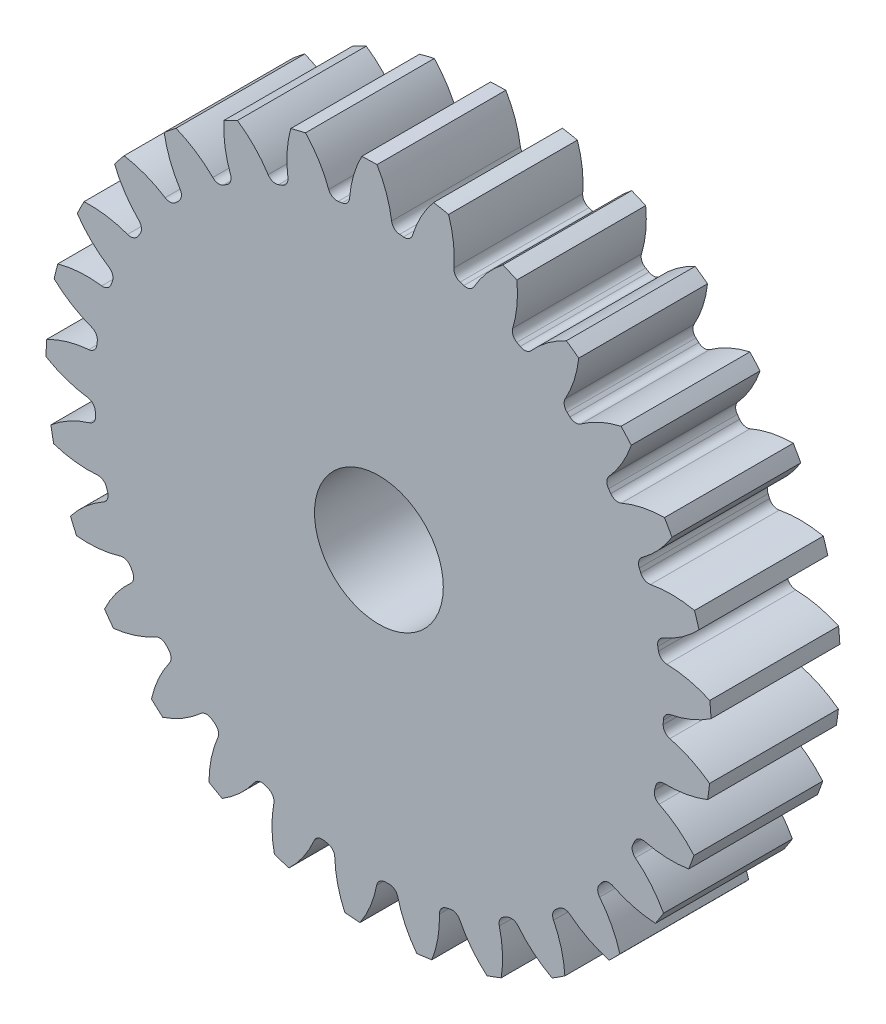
from build123d import *

# Parameters (mm, degrees)
SKETCH3_R         = 262.466666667
GEARBODY_DEPTH    = 101.6
TOOTHCUT_DEPTH    = 385.83770894
CIRPATTERN1_COUNT = 29
BOREDIA_R         = 50.8
BORE_DEPTH        = 12700


with BuildPart() as part:
    # Sketch3 → gearBody (new body)
    with BuildSketch(Plane.XY):
        Circle(SKETCH3_R)
    extrude(amount=GEARBODY_DEPTH)

    # Sketch2 → toothCut (cut, through all)
    with BuildSketch(Plane.XY):
        with BuildLine():
            ThreePointArc((224.249253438, -7.257647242), (224.293386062, -5.733941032), (224.327165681, -4.209970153))
            ThreePointArc((224.327165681, -4.209970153), (225.940127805, 0.09284515), (229.899366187, 2.425289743))
            ThreePointArc((229.899366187, 2.425289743), (246.875965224, 7.566161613), (262.466666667, 16.025683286))
            ThreePointArc((262.466666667, 16.025683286), (262.869575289, -6.720120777), (261.304983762, -29.415626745))
            ThreePointArc((261.304983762, -29.415626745), (246.166891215, -20.170539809), (229.475143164, -14.168954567))
            ThreePointArc((229.475143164, -14.168954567), (225.64025398, -11.637257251), (224.249253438, -7.257647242))
        make_face()
    toothcut = extrude(amount=TOOTHCUT_DEPTH, mode=Mode.SUBTRACT)

    # CirPattern1: toothCut ×29 about axis
    cirpattern1_axis = Axis((0, 0, 0), (0, 0, 1))
    for i in range(1, CIRPATTERN1_COUNT):
        add(toothcut.rotate(cirpattern1_axis, i * 360 / CIRPATTERN1_COUNT), mode=Mode.SUBTRACT)

    # boreDia → bore (cut, symmetric)
    with BuildSketch(Plane.XY):
        Circle(BOREDIA_R)
    extrude(amount=BORE_DEPTH, both=True, mode=Mode.SUBTRACT)


solid = part.part
